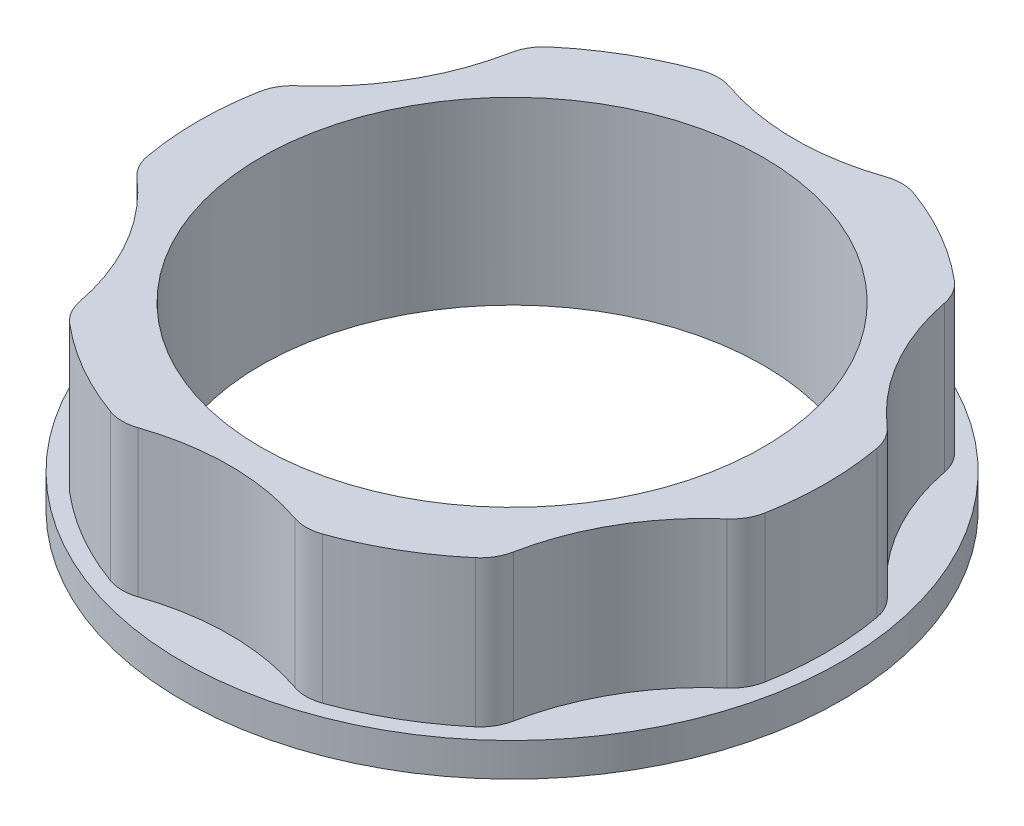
ISO-10303-21;
HEADER;
FILE_DESCRIPTION(('STEP AP214'),'2;1');
FILE_NAME('part.step','',(''),(''),'','','');
FILE_SCHEMA(('AUTOMOTIVE_DESIGN { 1 0 10303 214 1 1 1 1 }'));
ENDSEC;
DATA;
#1=APPLICATION_CONTEXT('core data for automotive mechanical design processes');
#2=APPLICATION_PROTOCOL_DEFINITION('international standard','automotive_design',2000,#1);
#3=PRODUCT_CONTEXT('',#1,'mechanical');
#4=PRODUCT('Part','Part','',(#3));
#5=PRODUCT_RELATED_PRODUCT_CATEGORY('part','',(#4));
#6=PRODUCT_DEFINITION_FORMATION('','',#4);
#7=PRODUCT_DEFINITION_CONTEXT('part definition',#1,'design');
#8=PRODUCT_DEFINITION('design','',#6,#7);
#9=PRODUCT_DEFINITION_SHAPE('','',#8);
#10=(LENGTH_UNIT() NAMED_UNIT(*) SI_UNIT(.MILLI.,.METRE.));
#11=(NAMED_UNIT(*) PLANE_ANGLE_UNIT() SI_UNIT($,.RADIAN.));
#12=(NAMED_UNIT(*) SI_UNIT($,.STERADIAN.) SOLID_ANGLE_UNIT());
#13=UNCERTAINTY_MEASURE_WITH_UNIT(LENGTH_MEASURE(1.E-05),#10,'distance_accuracy_value','');
#14=(GEOMETRIC_REPRESENTATION_CONTEXT(3) GLOBAL_UNCERTAINTY_ASSIGNED_CONTEXT((#13)) GLOBAL_UNIT_ASSIGNED_CONTEXT((#10,
#11,#12)) REPRESENTATION_CONTEXT('',''));
#15=CARTESIAN_POINT('',(0.,0.,0.));
#16=DIRECTION('',(0.,0.,1.));
#17=DIRECTION('',(1.,0.,0.));
#18=AXIS2_PLACEMENT_3D('',#15,#16,#17);
#19=CARTESIAN_POINT('',(-2.19685997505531,7.,-6.1175));
#20=DIRECTION('',(0.,1.,0.));
#21=DIRECTION('',(0.,0.,1.));
#22=AXIS2_PLACEMENT_3D('',#19,#20,#21);
#23=PLANE('',#22);
#24=CARTESIAN_POINT('',(-4.39371995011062,7.,-12.235));
#25=DIRECTION('',(0.,1.,0.));
#26=DIRECTION('',(0.,0.,1.));
#27=AXIS2_PLACEMENT_3D('',#24,#25,#26);
#28=CIRCLE('',#27,2.);
#29=CARTESIAN_POINT('',(-3.74279847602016,7.,-14.1261111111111));
#30=VERTEX_POINT('',#29);
#31=CARTESIAN_POINT('',(-5.06967686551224,7.,-14.1173076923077));
#32=VERTEX_POINT('',#31);
#33=EDGE_CURVE('E200',#30,#32,#28,.T.);
#34=ORIENTED_EDGE('',*,*,#33,.T.);
#35=CARTESIAN_POINT('',(0.,7.,0.));
#36=DIRECTION('',(0.,1.,0.));
#37=DIRECTION('',(0.,0.,1.));
#38=AXIS2_PLACEMENT_3D('',#35,#36,#37);
#39=CIRCLE('',#38,15.);
#40=CARTESIAN_POINT('',(-9.69110866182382,7.,-11.4491228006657));
#41=VERTEX_POINT('',#40);
#42=EDGE_CURVE('E286',#32,#41,#39,.T.);
#43=ORIENTED_EDGE('',*,*,#42,.T.);
#44=CARTESIAN_POINT('',(-8.39896084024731,7.,-9.92257309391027));
#45=DIRECTION('',(0.,1.,0.));
#46=DIRECTION('',(0.,0.,-1.));
#47=AXIS2_PLACEMENT_3D('',#44,#45,#46);
#48=CIRCLE('',#47,2.);
#49=CARTESIAN_POINT('',(-10.3621718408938,7.,-10.3044141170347));
#50=VERTEX_POINT('',#49);
#51=EDGE_CURVE('E282',#41,#50,#48,.T.);
#52=ORIENTED_EDGE('',*,*,#51,.T.);
#53=CARTESIAN_POINT('',(-21.650635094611,7.,-12.5));
#54=DIRECTION('',(0.,-1.,0.));
#55=DIRECTION('',(0.,0.,1.));
#56=AXIS2_PLACEMENT_3D('',#53,#54,#55);
#57=CIRCLE('',#56,11.5);
#58=CARTESIAN_POINT('',(-14.1049703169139,7.,-3.82169699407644));
#59=VERTEX_POINT('',#58);
#60=EDGE_CURVE('E441',#50,#59,#57,.T.);
#61=ORIENTED_EDGE('',*,*,#60,.T.);
#62=CARTESIAN_POINT('',(-12.7926807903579,7.,-2.31242690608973));
#63=DIRECTION('',(0.,1.,0.));
#64=DIRECTION('',(0.,0.,1.));
#65=AXIS2_PLACEMENT_3D('',#62,#63,#64);
#66=CIRCLE('',#65,2.);
#67=CARTESIAN_POINT('',(-14.760785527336,7.,-2.66818489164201));
#68=VERTEX_POINT('',#67);
#69=EDGE_CURVE('E437',#59,#68,#66,.T.);
#70=ORIENTED_EDGE('',*,*,#69,.T.);
#71=CARTESIAN_POINT('',(0.,7.,0.));
#72=DIRECTION('',(0.,1.,0.));
#73=DIRECTION('',(0.,0.,1.));
#74=AXIS2_PLACEMENT_3D('',#71,#72,#73);
#75=CIRCLE('',#74,15.);
#76=CARTESIAN_POINT('',(-14.7607855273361,7.,2.66818489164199));
#77=VERTEX_POINT('',#76);
#78=EDGE_CURVE('E431',#68,#77,#75,.T.);
#79=ORIENTED_EDGE('',*,*,#78,.T.);
#80=CARTESIAN_POINT('',(-12.7926807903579,7.,2.31242690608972));
#81=DIRECTION('',(0.,1.,0.));
#82=DIRECTION('',(0.,0.,-1.));
#83=AXIS2_PLACEMENT_3D('',#80,#81,#82);
#84=CIRCLE('',#83,2.);
#85=CARTESIAN_POINT('',(-14.1049703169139,7.,3.82169699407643));
#86=VERTEX_POINT('',#85);
#87=EDGE_CURVE('E427',#77,#86,#84,.T.);
#88=ORIENTED_EDGE('',*,*,#87,.T.);
#89=CARTESIAN_POINT('',(-21.650635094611,7.,12.5));
#90=DIRECTION('',(0.,-1.,0.));
#91=DIRECTION('',(0.,0.,1.));
#92=AXIS2_PLACEMENT_3D('',#89,#90,#91);
#93=CIRCLE('',#92,11.5);
#94=CARTESIAN_POINT('',(-10.3621718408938,7.,10.3044141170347));
#95=VERTEX_POINT('',#94);
#96=EDGE_CURVE('E421',#86,#95,#93,.T.);
#97=ORIENTED_EDGE('',*,*,#96,.T.);
#98=CARTESIAN_POINT('',(-8.39896084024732,7.,9.92257309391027));
#99=DIRECTION('',(0.,1.,0.));
#100=DIRECTION('',(0.,0.,1.));
#101=AXIS2_PLACEMENT_3D('',#98,#99,#100);
#102=CIRCLE('',#101,2.);
#103=CARTESIAN_POINT('',(-9.69110866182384,7.,11.4491228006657));
#104=VERTEX_POINT('',#103);
#105=EDGE_CURVE('E417',#95,#104,#102,.T.);
#106=ORIENTED_EDGE('',*,*,#105,.T.);
#107=CARTESIAN_POINT('',(0.,7.,0.));
#108=DIRECTION('',(0.,1.,0.));
#109=DIRECTION('',(0.,0.,1.));
#110=AXIS2_PLACEMENT_3D('',#107,#108,#109);
#111=CIRCLE('',#110,15.);
#112=CARTESIAN_POINT('',(-5.06967686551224,7.,14.1173076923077));
#113=VERTEX_POINT('',#112);
#114=EDGE_CURVE('E411',#104,#113,#111,.T.);
#115=ORIENTED_EDGE('',*,*,#114,.T.);
#116=CARTESIAN_POINT('',(-4.39371995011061,7.,12.235));
#117=DIRECTION('',(0.,1.,0.));
#118=DIRECTION('',(0.,0.,-1.));
#119=AXIS2_PLACEMENT_3D('',#116,#117,#118);
#120=CIRCLE('',#119,2.);
#121=CARTESIAN_POINT('',(-3.74279847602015,7.,14.1261111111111));
#122=VERTEX_POINT('',#121);
#123=EDGE_CURVE('E407',#113,#122,#120,.T.);
#124=ORIENTED_EDGE('',*,*,#123,.T.);
#125=CARTESIAN_POINT('',(0.,7.,25.));
#126=DIRECTION('',(0.,-1.,0.));
#127=DIRECTION('',(0.,0.,1.));
#128=AXIS2_PLACEMENT_3D('',#125,#126,#127);
#129=CIRCLE('',#128,11.5);
#130=CARTESIAN_POINT('',(3.74279847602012,7.,14.1261111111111));
#131=VERTEX_POINT('',#130);
#132=EDGE_CURVE('E401',#122,#131,#129,.T.);
#133=ORIENTED_EDGE('',*,*,#132,.T.);
#134=CARTESIAN_POINT('',(4.39371995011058,7.,12.235));
#135=DIRECTION('',(0.,1.,0.));
#136=DIRECTION('',(0.,0.,1.));
#137=AXIS2_PLACEMENT_3D('',#134,#135,#136);
#138=CIRCLE('',#137,2.);
#139=CARTESIAN_POINT('',(5.06967686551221,7.,14.1173076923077));
#140=VERTEX_POINT('',#139);
#141=EDGE_CURVE('E397',#131,#140,#138,.T.);
#142=ORIENTED_EDGE('',*,*,#141,.T.);
#143=CARTESIAN_POINT('',(0.,7.,0.));
#144=DIRECTION('',(0.,1.,0.));
#145=DIRECTION('',(0.,0.,1.));
#146=AXIS2_PLACEMENT_3D('',#143,#144,#145);
#147=CIRCLE('',#146,15.);
#148=CARTESIAN_POINT('',(9.69110866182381,7.,11.4491228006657));
#149=VERTEX_POINT('',#148);
#150=EDGE_CURVE('E391',#140,#149,#147,.T.);
#151=ORIENTED_EDGE('',*,*,#150,.T.);
#152=CARTESIAN_POINT('',(8.39896084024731,7.,9.92257309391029));
#153=DIRECTION('',(0.,1.,0.));
#154=DIRECTION('',(0.,0.,-1.));
#155=AXIS2_PLACEMENT_3D('',#152,#153,#154);
#156=CIRCLE('',#155,2.);
#157=CARTESIAN_POINT('',(10.3621718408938,7.,10.3044141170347));
#158=VERTEX_POINT('',#157);
#159=EDGE_CURVE('E387',#149,#158,#156,.T.);
#160=ORIENTED_EDGE('',*,*,#159,.T.);
#161=CARTESIAN_POINT('',(21.650635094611,7.,12.5));
#162=DIRECTION('',(0.,-1.,0.));
#163=DIRECTION('',(0.,0.,1.));
#164=AXIS2_PLACEMENT_3D('',#161,#162,#163);
#165=CIRCLE('',#164,11.5);
#166=CARTESIAN_POINT('',(14.1049703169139,7.,3.82169699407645));
#167=VERTEX_POINT('',#166);
#168=EDGE_CURVE('E381',#158,#167,#165,.T.);
#169=ORIENTED_EDGE('',*,*,#168,.T.);
#170=CARTESIAN_POINT('',(12.7926807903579,7.,2.31242690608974));
#171=DIRECTION('',(0.,1.,0.));
#172=DIRECTION('',(0.,0.,1.));
#173=AXIS2_PLACEMENT_3D('',#170,#171,#172);
#174=CIRCLE('',#173,2.);
#175=CARTESIAN_POINT('',(14.760785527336,7.,2.668184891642));
#176=VERTEX_POINT('',#175);
#177=EDGE_CURVE('E377',#167,#176,#174,.T.);
#178=ORIENTED_EDGE('',*,*,#177,.T.);
#179=CARTESIAN_POINT('',(0.,7.,0.));
#180=DIRECTION('',(0.,1.,0.));
#181=DIRECTION('',(0.,0.,1.));
#182=AXIS2_PLACEMENT_3D('',#179,#180,#181);
#183=CIRCLE('',#182,15.);
#184=CARTESIAN_POINT('',(14.7607855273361,7.,-2.66818489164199));
#185=VERTEX_POINT('',#184);
#186=EDGE_CURVE('E371',#176,#185,#183,.T.);
#187=ORIENTED_EDGE('',*,*,#186,.T.);
#188=CARTESIAN_POINT('',(12.7926807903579,7.,-2.31242690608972));
#189=DIRECTION('',(0.,1.,0.));
#190=DIRECTION('',(0.,0.,-1.));
#191=AXIS2_PLACEMENT_3D('',#188,#189,#190);
#192=CIRCLE('',#191,2.);
#193=CARTESIAN_POINT('',(14.1049703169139,7.,-3.82169699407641));
#194=VERTEX_POINT('',#193);
#195=EDGE_CURVE('E367',#185,#194,#192,.T.);
#196=ORIENTED_EDGE('',*,*,#195,.T.);
#197=CARTESIAN_POINT('',(21.650635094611,7.,-12.5));
#198=DIRECTION('',(0.,-1.,0.));
#199=DIRECTION('',(0.,0.,1.));
#200=AXIS2_PLACEMENT_3D('',#197,#198,#199);
#201=CIRCLE('',#200,11.5);
#202=CARTESIAN_POINT('',(10.3621718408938,7.,-10.3044141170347));
#203=VERTEX_POINT('',#202);
#204=EDGE_CURVE('E361',#194,#203,#201,.T.);
#205=ORIENTED_EDGE('',*,*,#204,.T.);
#206=CARTESIAN_POINT('',(8.39896084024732,7.,-9.92257309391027));
#207=DIRECTION('',(0.,1.,0.));
#208=DIRECTION('',(0.,0.,1.));
#209=AXIS2_PLACEMENT_3D('',#206,#207,#208);
#210=CIRCLE('',#209,2.);
#211=CARTESIAN_POINT('',(9.69110866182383,7.,-11.4491228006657));
#212=VERTEX_POINT('',#211);
#213=EDGE_CURVE('E357',#203,#212,#210,.T.);
#214=ORIENTED_EDGE('',*,*,#213,.T.);
#215=CARTESIAN_POINT('',(0.,7.,0.));
#216=DIRECTION('',(0.,1.,0.));
#217=DIRECTION('',(0.,0.,1.));
#218=AXIS2_PLACEMENT_3D('',#215,#216,#217);
#219=CIRCLE('',#218,15.);
#220=CARTESIAN_POINT('',(5.06967686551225,7.,-14.1173076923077));
#221=VERTEX_POINT('',#220);
#222=EDGE_CURVE('E463',#212,#221,#219,.T.);
#223=ORIENTED_EDGE('',*,*,#222,.T.);
#224=CARTESIAN_POINT('',(4.39371995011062,7.,-12.235));
#225=DIRECTION('',(0.,1.,0.));
#226=DIRECTION('',(0.,0.,-1.));
#227=AXIS2_PLACEMENT_3D('',#224,#225,#226);
#228=CIRCLE('',#227,2.);
#229=CARTESIAN_POINT('',(3.74279847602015,7.,-14.1261111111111));
#230=VERTEX_POINT('',#229);
#231=EDGE_CURVE('E465',#221,#230,#228,.T.);
#232=ORIENTED_EDGE('',*,*,#231,.T.);
#233=CARTESIAN_POINT('',(0.,7.,-25.));
#234=DIRECTION('',(0.,-1.,0.));
#235=DIRECTION('',(0.,0.,1.));
#236=AXIS2_PLACEMENT_3D('',#233,#234,#235);
#237=CIRCLE('',#236,11.5);
#238=EDGE_CURVE('E49',#230,#30,#237,.T.);
#239=ORIENTED_EDGE('',*,*,#238,.T.);
#240=EDGE_LOOP('',(#34,#43,#52,#61,#70,#79,#88,#97,#106,#115,#124,#133,#142,#151,#160,#169,#178,
#187,#196,#205,#214,#223,#232,#239));
#241=FACE_BOUND('',#240,.T.);
#242=CARTESIAN_POINT('',(0.,7.,0.));
#243=DIRECTION('',(0.,1.,0.));
#244=DIRECTION('',(0.,0.,1.));
#245=AXIS2_PLACEMENT_3D('',#242,#243,#244);
#246=CIRCLE('',#245,12.);
#247=CARTESIAN_POINT('',(0.,7.,12.));
#248=VERTEX_POINT('',#247);
#249=EDGE_CURVE('E292',#248,#248,#246,.T.);
#250=ORIENTED_EDGE('',*,*,#249,.F.);
#251=EDGE_LOOP('',(#250));
#252=FACE_BOUND('',#251,.T.);
#253=ADVANCED_FACE('F33',(#241,#252),#23,.T.);
#254=CARTESIAN_POINT('',(-4.39371995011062,7.,-12.235));
#255=DIRECTION('',(0.,-1.,0.));
#256=DIRECTION('',(0.,0.,-1.));
#257=AXIS2_PLACEMENT_3D('',#254,#255,#256);
#258=CYLINDRICAL_SURFACE('',#257,2.);
#259=CARTESIAN_POINT('',(-4.39371995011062,0.,-12.235));
#260=DIRECTION('',(0.,1.,0.));
#261=DIRECTION('',(0.,0.,1.));
#262=AXIS2_PLACEMENT_3D('',#259,#260,#261);
#263=CIRCLE('',#262,2.);
#264=CARTESIAN_POINT('',(-3.74279847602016,0.,-14.1261111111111));
#265=VERTEX_POINT('',#264);
#266=CARTESIAN_POINT('',(-5.06967686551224,0.,-14.1173076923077));
#267=VERTEX_POINT('',#266);
#268=EDGE_CURVE('E196',#265,#267,#263,.T.);
#269=ORIENTED_EDGE('',*,*,#268,.T.);
#270=DIRECTION('',(0.,-1.,0.));
#271=VECTOR('',#270,1.);
#272=CARTESIAN_POINT('',(-5.06967686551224,7.,-14.1173076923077));
#273=LINE('',#272,#271);
#274=EDGE_CURVE('E11',#32,#267,#273,.T.);
#275=ORIENTED_EDGE('',*,*,#274,.F.);
#276=ORIENTED_EDGE('',*,*,#33,.F.);
#277=DIRECTION('',(0.,-1.,0.));
#278=VECTOR('',#277,1.);
#279=CARTESIAN_POINT('',(-3.74279847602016,7.,-14.1261111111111));
#280=LINE('',#279,#278);
#281=EDGE_CURVE('E213',#30,#265,#280,.T.);
#282=ORIENTED_EDGE('',*,*,#281,.T.);
#283=EDGE_LOOP('',(#269,#275,#276,#282));
#284=FACE_BOUND('',#283,.T.);
#285=ADVANCED_FACE('F35',(#284),#258,.T.);
#286=CARTESIAN_POINT('',(0.,7.,0.));
#287=DIRECTION('',(0.,-1.,0.));
#288=DIRECTION('',(0.,0.,-1.));
#289=AXIS2_PLACEMENT_3D('',#286,#287,#288);
#290=CYLINDRICAL_SURFACE('',#289,15.);
#291=CARTESIAN_POINT('',(0.,0.,0.));
#292=DIRECTION('',(0.,1.,0.));
#293=DIRECTION('',(0.,0.,1.));
#294=AXIS2_PLACEMENT_3D('',#291,#292,#293);
#295=CIRCLE('',#294,15.);
#296=CARTESIAN_POINT('',(-9.69110866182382,0.,-11.4491228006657));
#297=VERTEX_POINT('',#296);
#298=EDGE_CURVE('E287',#267,#297,#295,.T.);
#299=ORIENTED_EDGE('',*,*,#298,.T.);
#300=DIRECTION('',(0.,-1.,0.));
#301=VECTOR('',#300,1.);
#302=CARTESIAN_POINT('',(-9.69110866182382,7.,-11.4491228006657));
#303=LINE('',#302,#301);
#304=EDGE_CURVE('E42',#41,#297,#303,.T.);
#305=ORIENTED_EDGE('',*,*,#304,.F.);
#306=ORIENTED_EDGE('',*,*,#42,.F.);
#307=ORIENTED_EDGE('',*,*,#274,.T.);
#308=EDGE_LOOP('',(#299,#305,#306,#307));
#309=FACE_BOUND('',#308,.T.);
#310=ADVANCED_FACE('F285',(#309),#290,.T.);
#311=CARTESIAN_POINT('',(-8.39896084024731,7.,-9.92257309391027));
#312=DIRECTION('',(0.,-1.,0.));
#313=DIRECTION('',(0.,0.,-1.));
#314=AXIS2_PLACEMENT_3D('',#311,#312,#313);
#315=CYLINDRICAL_SURFACE('',#314,2.);
#316=CARTESIAN_POINT('',(-8.39896084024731,0.,-9.92257309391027));
#317=DIRECTION('',(0.,1.,0.));
#318=DIRECTION('',(0.,0.,-1.));
#319=AXIS2_PLACEMENT_3D('',#316,#317,#318);
#320=CIRCLE('',#319,2.);
#321=CARTESIAN_POINT('',(-10.3621718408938,0.,-10.3044141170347));
#322=VERTEX_POINT('',#321);
#323=EDGE_CURVE('E281',#297,#322,#320,.T.);
#324=ORIENTED_EDGE('',*,*,#323,.T.);
#325=DIRECTION('',(0.,-1.,0.));
#326=VECTOR('',#325,1.);
#327=CARTESIAN_POINT('',(-10.3621718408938,7.,-10.3044141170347));
#328=LINE('',#327,#326);
#329=EDGE_CURVE('E272',#50,#322,#328,.T.);
#330=ORIENTED_EDGE('',*,*,#329,.F.);
#331=ORIENTED_EDGE('',*,*,#51,.F.);
#332=ORIENTED_EDGE('',*,*,#304,.T.);
#333=EDGE_LOOP('',(#324,#330,#331,#332));
#334=FACE_BOUND('',#333,.T.);
#335=ADVANCED_FACE('F279',(#334),#315,.T.);
#336=CARTESIAN_POINT('',(-21.650635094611,7.,-12.5));
#337=DIRECTION('',(0.,-1.,0.));
#338=DIRECTION('',(0.,0.,-1.));
#339=AXIS2_PLACEMENT_3D('',#336,#337,#338);
#340=CYLINDRICAL_SURFACE('',#339,11.5);
#341=CARTESIAN_POINT('',(-21.650635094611,0.,-12.5));
#342=DIRECTION('',(0.,-1.,0.));
#343=DIRECTION('',(0.,0.,1.));
#344=AXIS2_PLACEMENT_3D('',#341,#342,#343);
#345=CIRCLE('',#344,11.5);
#346=CARTESIAN_POINT('',(-14.1049703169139,0.,-3.82169699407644));
#347=VERTEX_POINT('',#346);
#348=EDGE_CURVE('E290',#322,#347,#345,.T.);
#349=ORIENTED_EDGE('',*,*,#348,.T.);
#350=DIRECTION('',(0.,-1.,0.));
#351=VECTOR('',#350,1.);
#352=CARTESIAN_POINT('',(-14.1049703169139,7.,-3.82169699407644));
#353=LINE('',#352,#351);
#354=EDGE_CURVE('E269',#59,#347,#353,.T.);
#355=ORIENTED_EDGE('',*,*,#354,.F.);
#356=ORIENTED_EDGE('',*,*,#60,.F.);
#357=ORIENTED_EDGE('',*,*,#329,.T.);
#358=EDGE_LOOP('',(#349,#355,#356,#357));
#359=FACE_BOUND('',#358,.T.);
#360=ADVANCED_FACE('F440',(#359),#340,.F.);
#361=CARTESIAN_POINT('',(-12.7926807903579,7.,-2.31242690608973));
#362=DIRECTION('',(0.,-1.,0.));
#363=DIRECTION('',(0.,0.,-1.));
#364=AXIS2_PLACEMENT_3D('',#361,#362,#363);
#365=CYLINDRICAL_SURFACE('',#364,2.);
#366=CARTESIAN_POINT('',(-12.7926807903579,0.,-2.31242690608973));
#367=DIRECTION('',(0.,1.,0.));
#368=DIRECTION('',(0.,0.,1.));
#369=AXIS2_PLACEMENT_3D('',#366,#367,#368);
#370=CIRCLE('',#369,2.);
#371=CARTESIAN_POINT('',(-14.760785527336,0.,-2.66818489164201));
#372=VERTEX_POINT('',#371);
#373=EDGE_CURVE('E298',#347,#372,#370,.T.);
#374=ORIENTED_EDGE('',*,*,#373,.T.);
#375=DIRECTION('',(0.,-1.,0.));
#376=VECTOR('',#375,1.);
#377=CARTESIAN_POINT('',(-14.760785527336,7.,-2.66818489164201));
#378=LINE('',#377,#376);
#379=EDGE_CURVE('E266',#68,#372,#378,.T.);
#380=ORIENTED_EDGE('',*,*,#379,.F.);
#381=ORIENTED_EDGE('',*,*,#69,.F.);
#382=ORIENTED_EDGE('',*,*,#354,.T.);
#383=EDGE_LOOP('',(#374,#380,#381,#382));
#384=FACE_BOUND('',#383,.T.);
#385=ADVANCED_FACE('F434',(#384),#365,.T.);
#386=CARTESIAN_POINT('',(0.,7.,0.));
#387=DIRECTION('',(0.,-1.,0.));
#388=DIRECTION('',(0.,0.,-1.));
#389=AXIS2_PLACEMENT_3D('',#386,#387,#388);
#390=CYLINDRICAL_SURFACE('',#389,15.);
#391=CARTESIAN_POINT('',(0.,0.,0.));
#392=DIRECTION('',(0.,1.,0.));
#393=DIRECTION('',(0.,0.,1.));
#394=AXIS2_PLACEMENT_3D('',#391,#392,#393);
#395=CIRCLE('',#394,15.);
#396=CARTESIAN_POINT('',(-14.7607855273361,0.,2.66818489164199));
#397=VERTEX_POINT('',#396);
#398=EDGE_CURVE('E301',#372,#397,#395,.T.);
#399=ORIENTED_EDGE('',*,*,#398,.T.);
#400=DIRECTION('',(0.,-1.,0.));
#401=VECTOR('',#400,1.);
#402=CARTESIAN_POINT('',(-14.7607855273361,7.,2.66818489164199));
#403=LINE('',#402,#401);
#404=EDGE_CURVE('E263',#77,#397,#403,.T.);
#405=ORIENTED_EDGE('',*,*,#404,.F.);
#406=ORIENTED_EDGE('',*,*,#78,.F.);
#407=ORIENTED_EDGE('',*,*,#379,.T.);
#408=EDGE_LOOP('',(#399,#405,#406,#407));
#409=FACE_BOUND('',#408,.T.);
#410=ADVANCED_FACE('F430',(#409),#390,.T.);
#411=CARTESIAN_POINT('',(-12.7926807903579,7.,2.31242690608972));
#412=DIRECTION('',(0.,-1.,0.));
#413=DIRECTION('',(0.,0.,-1.));
#414=AXIS2_PLACEMENT_3D('',#411,#412,#413);
#415=CYLINDRICAL_SURFACE('',#414,2.);
#416=CARTESIAN_POINT('',(-12.7926807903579,0.,2.31242690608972));
#417=DIRECTION('',(0.,1.,0.));
#418=DIRECTION('',(0.,0.,-1.));
#419=AXIS2_PLACEMENT_3D('',#416,#417,#418);
#420=CIRCLE('',#419,2.);
#421=CARTESIAN_POINT('',(-14.1049703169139,0.,3.82169699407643));
#422=VERTEX_POINT('',#421);
#423=EDGE_CURVE('E304',#397,#422,#420,.T.);
#424=ORIENTED_EDGE('',*,*,#423,.T.);
#425=DIRECTION('',(0.,-1.,0.));
#426=VECTOR('',#425,1.);
#427=CARTESIAN_POINT('',(-14.1049703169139,7.,3.82169699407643));
#428=LINE('',#427,#426);
#429=EDGE_CURVE('E260',#86,#422,#428,.T.);
#430=ORIENTED_EDGE('',*,*,#429,.F.);
#431=ORIENTED_EDGE('',*,*,#87,.F.);
#432=ORIENTED_EDGE('',*,*,#404,.T.);
#433=EDGE_LOOP('',(#424,#430,#431,#432));
#434=FACE_BOUND('',#433,.T.);
#435=ADVANCED_FACE('F424',(#434),#415,.T.);
#436=CARTESIAN_POINT('',(-21.650635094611,7.,12.5));
#437=DIRECTION('',(0.,-1.,0.));
#438=DIRECTION('',(0.,0.,-1.));
#439=AXIS2_PLACEMENT_3D('',#436,#437,#438);
#440=CYLINDRICAL_SURFACE('',#439,11.5);
#441=CARTESIAN_POINT('',(-21.650635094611,0.,12.5));
#442=DIRECTION('',(0.,-1.,0.));
#443=DIRECTION('',(0.,0.,1.));
#444=AXIS2_PLACEMENT_3D('',#441,#442,#443);
#445=CIRCLE('',#444,11.5);
#446=CARTESIAN_POINT('',(-10.3621718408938,0.,10.3044141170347));
#447=VERTEX_POINT('',#446);
#448=EDGE_CURVE('E307',#422,#447,#445,.T.);
#449=ORIENTED_EDGE('',*,*,#448,.T.);
#450=DIRECTION('',(0.,-1.,0.));
#451=VECTOR('',#450,1.);
#452=CARTESIAN_POINT('',(-10.3621718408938,7.,10.3044141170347));
#453=LINE('',#452,#451);
#454=EDGE_CURVE('E257',#95,#447,#453,.T.);
#455=ORIENTED_EDGE('',*,*,#454,.F.);
#456=ORIENTED_EDGE('',*,*,#96,.F.);
#457=ORIENTED_EDGE('',*,*,#429,.T.);
#458=EDGE_LOOP('',(#449,#455,#456,#457));
#459=FACE_BOUND('',#458,.T.);
#460=ADVANCED_FACE('F420',(#459),#440,.F.);
#461=CARTESIAN_POINT('',(-8.39896084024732,7.,9.92257309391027));
#462=DIRECTION('',(0.,-1.,0.));
#463=DIRECTION('',(0.,0.,-1.));
#464=AXIS2_PLACEMENT_3D('',#461,#462,#463);
#465=CYLINDRICAL_SURFACE('',#464,2.);
#466=CARTESIAN_POINT('',(-8.39896084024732,0.,9.92257309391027));
#467=DIRECTION('',(0.,1.,0.));
#468=DIRECTION('',(0.,0.,1.));
#469=AXIS2_PLACEMENT_3D('',#466,#467,#468);
#470=CIRCLE('',#469,2.);
#471=CARTESIAN_POINT('',(-9.69110866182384,0.,11.4491228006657));
#472=VERTEX_POINT('',#471);
#473=EDGE_CURVE('E310',#447,#472,#470,.T.);
#474=ORIENTED_EDGE('',*,*,#473,.T.);
#475=DIRECTION('',(0.,-1.,0.));
#476=VECTOR('',#475,1.);
#477=CARTESIAN_POINT('',(-9.69110866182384,7.,11.4491228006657));
#478=LINE('',#477,#476);
#479=EDGE_CURVE('E254',#104,#472,#478,.T.);
#480=ORIENTED_EDGE('',*,*,#479,.F.);
#481=ORIENTED_EDGE('',*,*,#105,.F.);
#482=ORIENTED_EDGE('',*,*,#454,.T.);
#483=EDGE_LOOP('',(#474,#480,#481,#482));
#484=FACE_BOUND('',#483,.T.);
#485=ADVANCED_FACE('F414',(#484),#465,.T.);
#486=CARTESIAN_POINT('',(0.,7.,0.));
#487=DIRECTION('',(0.,-1.,0.));
#488=DIRECTION('',(0.,0.,-1.));
#489=AXIS2_PLACEMENT_3D('',#486,#487,#488);
#490=CYLINDRICAL_SURFACE('',#489,15.);
#491=CARTESIAN_POINT('',(0.,0.,0.));
#492=DIRECTION('',(0.,1.,0.));
#493=DIRECTION('',(0.,0.,1.));
#494=AXIS2_PLACEMENT_3D('',#491,#492,#493);
#495=CIRCLE('',#494,15.);
#496=CARTESIAN_POINT('',(-5.06967686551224,0.,14.1173076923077));
#497=VERTEX_POINT('',#496);
#498=EDGE_CURVE('E313',#472,#497,#495,.T.);
#499=ORIENTED_EDGE('',*,*,#498,.T.);
#500=DIRECTION('',(0.,-1.,0.));
#501=VECTOR('',#500,1.);
#502=CARTESIAN_POINT('',(-5.06967686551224,7.,14.1173076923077));
#503=LINE('',#502,#501);
#504=EDGE_CURVE('E251',#113,#497,#503,.T.);
#505=ORIENTED_EDGE('',*,*,#504,.F.);
#506=ORIENTED_EDGE('',*,*,#114,.F.);
#507=ORIENTED_EDGE('',*,*,#479,.T.);
#508=EDGE_LOOP('',(#499,#505,#506,#507));
#509=FACE_BOUND('',#508,.T.);
#510=ADVANCED_FACE('F410',(#509),#490,.T.);
#511=CARTESIAN_POINT('',(-4.39371995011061,7.,12.235));
#512=DIRECTION('',(0.,-1.,0.));
#513=DIRECTION('',(0.,0.,-1.));
#514=AXIS2_PLACEMENT_3D('',#511,#512,#513);
#515=CYLINDRICAL_SURFACE('',#514,2.);
#516=CARTESIAN_POINT('',(-4.39371995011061,0.,12.235));
#517=DIRECTION('',(0.,1.,0.));
#518=DIRECTION('',(0.,0.,-1.));
#519=AXIS2_PLACEMENT_3D('',#516,#517,#518);
#520=CIRCLE('',#519,2.);
#521=CARTESIAN_POINT('',(-3.74279847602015,0.,14.1261111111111));
#522=VERTEX_POINT('',#521);
#523=EDGE_CURVE('E316',#497,#522,#520,.T.);
#524=ORIENTED_EDGE('',*,*,#523,.T.);
#525=DIRECTION('',(0.,-1.,0.));
#526=VECTOR('',#525,1.);
#527=CARTESIAN_POINT('',(-3.74279847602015,7.,14.1261111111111));
#528=LINE('',#527,#526);
#529=EDGE_CURVE('E248',#122,#522,#528,.T.);
#530=ORIENTED_EDGE('',*,*,#529,.F.);
#531=ORIENTED_EDGE('',*,*,#123,.F.);
#532=ORIENTED_EDGE('',*,*,#504,.T.);
#533=EDGE_LOOP('',(#524,#530,#531,#532));
#534=FACE_BOUND('',#533,.T.);
#535=ADVANCED_FACE('F404',(#534),#515,.T.);
#536=CARTESIAN_POINT('',(0.,7.,25.));
#537=DIRECTION('',(0.,-1.,0.));
#538=DIRECTION('',(0.,0.,-1.));
#539=AXIS2_PLACEMENT_3D('',#536,#537,#538);
#540=CYLINDRICAL_SURFACE('',#539,11.5);
#541=CARTESIAN_POINT('',(0.,0.,25.));
#542=DIRECTION('',(0.,-1.,0.));
#543=DIRECTION('',(0.,0.,1.));
#544=AXIS2_PLACEMENT_3D('',#541,#542,#543);
#545=CIRCLE('',#544,11.5);
#546=CARTESIAN_POINT('',(3.74279847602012,0.,14.1261111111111));
#547=VERTEX_POINT('',#546);
#548=EDGE_CURVE('E319',#522,#547,#545,.T.);
#549=ORIENTED_EDGE('',*,*,#548,.T.);
#550=DIRECTION('',(0.,-1.,0.));
#551=VECTOR('',#550,1.);
#552=CARTESIAN_POINT('',(3.74279847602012,7.,14.1261111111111));
#553=LINE('',#552,#551);
#554=EDGE_CURVE('E245',#131,#547,#553,.T.);
#555=ORIENTED_EDGE('',*,*,#554,.F.);
#556=ORIENTED_EDGE('',*,*,#132,.F.);
#557=ORIENTED_EDGE('',*,*,#529,.T.);
#558=EDGE_LOOP('',(#549,#555,#556,#557));
#559=FACE_BOUND('',#558,.T.);
#560=ADVANCED_FACE('F400',(#559),#540,.F.);
#561=CARTESIAN_POINT('',(4.39371995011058,7.,12.235));
#562=DIRECTION('',(0.,-1.,0.));
#563=DIRECTION('',(0.,0.,-1.));
#564=AXIS2_PLACEMENT_3D('',#561,#562,#563);
#565=CYLINDRICAL_SURFACE('',#564,2.);
#566=CARTESIAN_POINT('',(4.39371995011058,0.,12.235));
#567=DIRECTION('',(0.,1.,0.));
#568=DIRECTION('',(0.,0.,1.));
#569=AXIS2_PLACEMENT_3D('',#566,#567,#568);
#570=CIRCLE('',#569,2.);
#571=CARTESIAN_POINT('',(5.06967686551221,0.,14.1173076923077));
#572=VERTEX_POINT('',#571);
#573=EDGE_CURVE('E322',#547,#572,#570,.T.);
#574=ORIENTED_EDGE('',*,*,#573,.T.);
#575=DIRECTION('',(0.,-1.,0.));
#576=VECTOR('',#575,1.);
#577=CARTESIAN_POINT('',(5.06967686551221,7.,14.1173076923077));
#578=LINE('',#577,#576);
#579=EDGE_CURVE('E242',#140,#572,#578,.T.);
#580=ORIENTED_EDGE('',*,*,#579,.F.);
#581=ORIENTED_EDGE('',*,*,#141,.F.);
#582=ORIENTED_EDGE('',*,*,#554,.T.);
#583=EDGE_LOOP('',(#574,#580,#581,#582));
#584=FACE_BOUND('',#583,.T.);
#585=ADVANCED_FACE('F394',(#584),#565,.T.);
#586=CARTESIAN_POINT('',(0.,7.,0.));
#587=DIRECTION('',(0.,-1.,0.));
#588=DIRECTION('',(0.,0.,-1.));
#589=AXIS2_PLACEMENT_3D('',#586,#587,#588);
#590=CYLINDRICAL_SURFACE('',#589,15.);
#591=CARTESIAN_POINT('',(0.,0.,0.));
#592=DIRECTION('',(0.,1.,0.));
#593=DIRECTION('',(0.,0.,1.));
#594=AXIS2_PLACEMENT_3D('',#591,#592,#593);
#595=CIRCLE('',#594,15.);
#596=CARTESIAN_POINT('',(9.69110866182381,0.,11.4491228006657));
#597=VERTEX_POINT('',#596);
#598=EDGE_CURVE('E325',#572,#597,#595,.T.);
#599=ORIENTED_EDGE('',*,*,#598,.T.);
#600=DIRECTION('',(0.,-1.,0.));
#601=VECTOR('',#600,1.);
#602=CARTESIAN_POINT('',(9.69110866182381,7.,11.4491228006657));
#603=LINE('',#602,#601);
#604=EDGE_CURVE('E239',#149,#597,#603,.T.);
#605=ORIENTED_EDGE('',*,*,#604,.F.);
#606=ORIENTED_EDGE('',*,*,#150,.F.);
#607=ORIENTED_EDGE('',*,*,#579,.T.);
#608=EDGE_LOOP('',(#599,#605,#606,#607));
#609=FACE_BOUND('',#608,.T.);
#610=ADVANCED_FACE('F390',(#609),#590,.T.);
#611=CARTESIAN_POINT('',(8.39896084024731,7.,9.92257309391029));
#612=DIRECTION('',(0.,-1.,0.));
#613=DIRECTION('',(0.,0.,-1.));
#614=AXIS2_PLACEMENT_3D('',#611,#612,#613);
#615=CYLINDRICAL_SURFACE('',#614,2.);
#616=CARTESIAN_POINT('',(8.39896084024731,0.,9.92257309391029));
#617=DIRECTION('',(0.,1.,0.));
#618=DIRECTION('',(0.,0.,-1.));
#619=AXIS2_PLACEMENT_3D('',#616,#617,#618);
#620=CIRCLE('',#619,2.);
#621=CARTESIAN_POINT('',(10.3621718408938,0.,10.3044141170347));
#622=VERTEX_POINT('',#621);
#623=EDGE_CURVE('E328',#597,#622,#620,.T.);
#624=ORIENTED_EDGE('',*,*,#623,.T.);
#625=DIRECTION('',(0.,-1.,0.));
#626=VECTOR('',#625,1.);
#627=CARTESIAN_POINT('',(10.3621718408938,7.,10.3044141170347));
#628=LINE('',#627,#626);
#629=EDGE_CURVE('E236',#158,#622,#628,.T.);
#630=ORIENTED_EDGE('',*,*,#629,.F.);
#631=ORIENTED_EDGE('',*,*,#159,.F.);
#632=ORIENTED_EDGE('',*,*,#604,.T.);
#633=EDGE_LOOP('',(#624,#630,#631,#632));
#634=FACE_BOUND('',#633,.T.);
#635=ADVANCED_FACE('F384',(#634),#615,.T.);
#636=CARTESIAN_POINT('',(21.650635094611,7.,12.5));
#637=DIRECTION('',(0.,-1.,0.));
#638=DIRECTION('',(0.,0.,-1.));
#639=AXIS2_PLACEMENT_3D('',#636,#637,#638);
#640=CYLINDRICAL_SURFACE('',#639,11.5);
#641=CARTESIAN_POINT('',(21.650635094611,0.,12.5));
#642=DIRECTION('',(0.,-1.,0.));
#643=DIRECTION('',(0.,0.,1.));
#644=AXIS2_PLACEMENT_3D('',#641,#642,#643);
#645=CIRCLE('',#644,11.5);
#646=CARTESIAN_POINT('',(14.1049703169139,0.,3.82169699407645));
#647=VERTEX_POINT('',#646);
#648=EDGE_CURVE('E331',#622,#647,#645,.T.);
#649=ORIENTED_EDGE('',*,*,#648,.T.);
#650=DIRECTION('',(0.,-1.,0.));
#651=VECTOR('',#650,1.);
#652=CARTESIAN_POINT('',(14.1049703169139,7.,3.82169699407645));
#653=LINE('',#652,#651);
#654=EDGE_CURVE('E233',#167,#647,#653,.T.);
#655=ORIENTED_EDGE('',*,*,#654,.F.);
#656=ORIENTED_EDGE('',*,*,#168,.F.);
#657=ORIENTED_EDGE('',*,*,#629,.T.);
#658=EDGE_LOOP('',(#649,#655,#656,#657));
#659=FACE_BOUND('',#658,.T.);
#660=ADVANCED_FACE('F380',(#659),#640,.F.);
#661=CARTESIAN_POINT('',(12.7926807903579,7.,2.31242690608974));
#662=DIRECTION('',(0.,-1.,0.));
#663=DIRECTION('',(0.,0.,-1.));
#664=AXIS2_PLACEMENT_3D('',#661,#662,#663);
#665=CYLINDRICAL_SURFACE('',#664,2.);
#666=CARTESIAN_POINT('',(12.7926807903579,0.,2.31242690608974));
#667=DIRECTION('',(0.,1.,0.));
#668=DIRECTION('',(0.,0.,1.));
#669=AXIS2_PLACEMENT_3D('',#666,#667,#668);
#670=CIRCLE('',#669,2.);
#671=CARTESIAN_POINT('',(14.7607855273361,0.,2.668184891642));
#672=VERTEX_POINT('',#671);
#673=EDGE_CURVE('E334',#647,#672,#670,.T.);
#674=ORIENTED_EDGE('',*,*,#673,.T.);
#675=DIRECTION('',(0.,-1.,0.));
#676=VECTOR('',#675,1.);
#677=CARTESIAN_POINT('',(14.760785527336,7.,2.668184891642));
#678=LINE('',#677,#676);
#679=EDGE_CURVE('E230',#176,#672,#678,.T.);
#680=ORIENTED_EDGE('',*,*,#679,.F.);
#681=ORIENTED_EDGE('',*,*,#177,.F.);
#682=ORIENTED_EDGE('',*,*,#654,.T.);
#683=EDGE_LOOP('',(#674,#680,#681,#682));
#684=FACE_BOUND('',#683,.T.);
#685=ADVANCED_FACE('F374',(#684),#665,.T.);
#686=CARTESIAN_POINT('',(0.,7.,0.));
#687=DIRECTION('',(0.,-1.,0.));
#688=DIRECTION('',(0.,0.,-1.));
#689=AXIS2_PLACEMENT_3D('',#686,#687,#688);
#690=CYLINDRICAL_SURFACE('',#689,15.);
#691=CARTESIAN_POINT('',(0.,0.,0.));
#692=DIRECTION('',(0.,1.,0.));
#693=DIRECTION('',(0.,0.,1.));
#694=AXIS2_PLACEMENT_3D('',#691,#692,#693);
#695=CIRCLE('',#694,15.);
#696=CARTESIAN_POINT('',(14.7607855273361,0.,-2.66818489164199));
#697=VERTEX_POINT('',#696);
#698=EDGE_CURVE('E337',#672,#697,#695,.T.);
#699=ORIENTED_EDGE('',*,*,#698,.T.);
#700=DIRECTION('',(0.,-1.,0.));
#701=VECTOR('',#700,1.);
#702=CARTESIAN_POINT('',(14.7607855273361,7.,-2.66818489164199));
#703=LINE('',#702,#701);
#704=EDGE_CURVE('E227',#185,#697,#703,.T.);
#705=ORIENTED_EDGE('',*,*,#704,.F.);
#706=ORIENTED_EDGE('',*,*,#186,.F.);
#707=ORIENTED_EDGE('',*,*,#679,.T.);
#708=EDGE_LOOP('',(#699,#705,#706,#707));
#709=FACE_BOUND('',#708,.T.);
#710=ADVANCED_FACE('F370',(#709),#690,.T.);
#711=CARTESIAN_POINT('',(12.7926807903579,7.,-2.31242690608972));
#712=DIRECTION('',(0.,-1.,0.));
#713=DIRECTION('',(0.,0.,-1.));
#714=AXIS2_PLACEMENT_3D('',#711,#712,#713);
#715=CYLINDRICAL_SURFACE('',#714,2.);
#716=CARTESIAN_POINT('',(12.7926807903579,0.,-2.31242690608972));
#717=DIRECTION('',(0.,1.,0.));
#718=DIRECTION('',(0.,0.,-1.));
#719=AXIS2_PLACEMENT_3D('',#716,#717,#718);
#720=CIRCLE('',#719,2.);
#721=CARTESIAN_POINT('',(14.1049703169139,0.,-3.82169699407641));
#722=VERTEX_POINT('',#721);
#723=EDGE_CURVE('E340',#697,#722,#720,.T.);
#724=ORIENTED_EDGE('',*,*,#723,.T.);
#725=DIRECTION('',(0.,-1.,0.));
#726=VECTOR('',#725,1.);
#727=CARTESIAN_POINT('',(14.1049703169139,7.,-3.82169699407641));
#728=LINE('',#727,#726);
#729=EDGE_CURVE('E224',#194,#722,#728,.T.);
#730=ORIENTED_EDGE('',*,*,#729,.F.);
#731=ORIENTED_EDGE('',*,*,#195,.F.);
#732=ORIENTED_EDGE('',*,*,#704,.T.);
#733=EDGE_LOOP('',(#724,#730,#731,#732));
#734=FACE_BOUND('',#733,.T.);
#735=ADVANCED_FACE('F364',(#734),#715,.T.);
#736=CARTESIAN_POINT('',(21.650635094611,7.,-12.5));
#737=DIRECTION('',(0.,-1.,0.));
#738=DIRECTION('',(0.,0.,-1.));
#739=AXIS2_PLACEMENT_3D('',#736,#737,#738);
#740=CYLINDRICAL_SURFACE('',#739,11.5);
#741=CARTESIAN_POINT('',(21.650635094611,0.,-12.5));
#742=DIRECTION('',(0.,-1.,0.));
#743=DIRECTION('',(0.,0.,1.));
#744=AXIS2_PLACEMENT_3D('',#741,#742,#743);
#745=CIRCLE('',#744,11.5);
#746=CARTESIAN_POINT('',(10.3621718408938,0.,-10.3044141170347));
#747=VERTEX_POINT('',#746);
#748=EDGE_CURVE('E343',#722,#747,#745,.T.);
#749=ORIENTED_EDGE('',*,*,#748,.T.);
#750=DIRECTION('',(0.,-1.,0.));
#751=VECTOR('',#750,1.);
#752=CARTESIAN_POINT('',(10.3621718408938,7.,-10.3044141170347));
#753=LINE('',#752,#751);
#754=EDGE_CURVE('E221',#203,#747,#753,.T.);
#755=ORIENTED_EDGE('',*,*,#754,.F.);
#756=ORIENTED_EDGE('',*,*,#204,.F.);
#757=ORIENTED_EDGE('',*,*,#729,.T.);
#758=EDGE_LOOP('',(#749,#755,#756,#757));
#759=FACE_BOUND('',#758,.T.);
#760=ADVANCED_FACE('F360',(#759),#740,.F.);
#761=CARTESIAN_POINT('',(8.39896084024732,7.,-9.92257309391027));
#762=DIRECTION('',(0.,-1.,0.));
#763=DIRECTION('',(0.,0.,-1.));
#764=AXIS2_PLACEMENT_3D('',#761,#762,#763);
#765=CYLINDRICAL_SURFACE('',#764,2.);
#766=CARTESIAN_POINT('',(8.39896084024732,0.,-9.92257309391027));
#767=DIRECTION('',(0.,1.,0.));
#768=DIRECTION('',(0.,0.,1.));
#769=AXIS2_PLACEMENT_3D('',#766,#767,#768);
#770=CIRCLE('',#769,2.);
#771=CARTESIAN_POINT('',(9.69110866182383,0.,-11.4491228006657));
#772=VERTEX_POINT('',#771);
#773=EDGE_CURVE('E346',#747,#772,#770,.T.);
#774=ORIENTED_EDGE('',*,*,#773,.T.);
#775=DIRECTION('',(0.,-1.,0.));
#776=VECTOR('',#775,1.);
#777=CARTESIAN_POINT('',(9.69110866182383,7.,-11.4491228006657));
#778=LINE('',#777,#776);
#779=EDGE_CURVE('E215',#212,#772,#778,.T.);
#780=ORIENTED_EDGE('',*,*,#779,.F.);
#781=ORIENTED_EDGE('',*,*,#213,.F.);
#782=ORIENTED_EDGE('',*,*,#754,.T.);
#783=EDGE_LOOP('',(#774,#780,#781,#782));
#784=FACE_BOUND('',#783,.T.);
#785=ADVANCED_FACE('F354',(#784),#765,.T.);
#786=CARTESIAN_POINT('',(0.,7.,0.));
#787=DIRECTION('',(0.,-1.,0.));
#788=DIRECTION('',(0.,0.,-1.));
#789=AXIS2_PLACEMENT_3D('',#786,#787,#788);
#790=CYLINDRICAL_SURFACE('',#789,15.);
#791=CARTESIAN_POINT('',(0.,0.,0.));
#792=DIRECTION('',(0.,1.,0.));
#793=DIRECTION('',(0.,0.,1.));
#794=AXIS2_PLACEMENT_3D('',#791,#792,#793);
#795=CIRCLE('',#794,15.);
#796=CARTESIAN_POINT('',(5.06967686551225,0.,-14.1173076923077));
#797=VERTEX_POINT('',#796);
#798=EDGE_CURVE('E210',#772,#797,#795,.T.);
#799=ORIENTED_EDGE('',*,*,#798,.T.);
#800=DIRECTION('',(0.,-1.,0.));
#801=VECTOR('',#800,1.);
#802=CARTESIAN_POINT('',(5.06967686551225,7.,-14.1173076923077));
#803=LINE('',#802,#801);
#804=EDGE_CURVE('E209',#221,#797,#803,.T.);
#805=ORIENTED_EDGE('',*,*,#804,.F.);
#806=ORIENTED_EDGE('',*,*,#222,.F.);
#807=ORIENTED_EDGE('',*,*,#779,.T.);
#808=EDGE_LOOP('',(#799,#805,#806,#807));
#809=FACE_BOUND('',#808,.T.);
#810=ADVANCED_FACE('F350',(#809),#790,.T.);
#811=CARTESIAN_POINT('',(4.39371995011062,7.,-12.235));
#812=DIRECTION('',(0.,-1.,0.));
#813=DIRECTION('',(0.,0.,-1.));
#814=AXIS2_PLACEMENT_3D('',#811,#812,#813);
#815=CYLINDRICAL_SURFACE('',#814,2.);
#816=CARTESIAN_POINT('',(4.39371995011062,0.,-12.235));
#817=DIRECTION('',(0.,1.,0.));
#818=DIRECTION('',(0.,0.,-1.));
#819=AXIS2_PLACEMENT_3D('',#816,#817,#818);
#820=CIRCLE('',#819,2.);
#821=CARTESIAN_POINT('',(3.74279847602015,0.,-14.1261111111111));
#822=VERTEX_POINT('',#821);
#823=EDGE_CURVE('E193',#797,#822,#820,.T.);
#824=ORIENTED_EDGE('',*,*,#823,.T.);
#825=DIRECTION('',(0.,-1.,0.));
#826=VECTOR('',#825,1.);
#827=CARTESIAN_POINT('',(3.74279847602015,7.,-14.1261111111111));
#828=LINE('',#827,#826);
#829=EDGE_CURVE('E207',#230,#822,#828,.T.);
#830=ORIENTED_EDGE('',*,*,#829,.F.);
#831=ORIENTED_EDGE('',*,*,#231,.F.);
#832=ORIENTED_EDGE('',*,*,#804,.T.);
#833=EDGE_LOOP('',(#824,#830,#831,#832));
#834=FACE_BOUND('',#833,.T.);
#835=ADVANCED_FACE('F205',(#834),#815,.T.);
#836=CARTESIAN_POINT('',(0.,7.,-25.));
#837=DIRECTION('',(0.,-1.,0.));
#838=DIRECTION('',(0.,0.,-1.));
#839=AXIS2_PLACEMENT_3D('',#836,#837,#838);
#840=CYLINDRICAL_SURFACE('',#839,11.5);
#841=CARTESIAN_POINT('',(0.,0.,-25.));
#842=DIRECTION('',(0.,-1.,0.));
#843=DIRECTION('',(0.,0.,1.));
#844=AXIS2_PLACEMENT_3D('',#841,#842,#843);
#845=CIRCLE('',#844,11.5);
#846=EDGE_CURVE('E190',#822,#265,#845,.T.);
#847=ORIENTED_EDGE('',*,*,#846,.T.);
#848=ORIENTED_EDGE('',*,*,#281,.F.);
#849=ORIENTED_EDGE('',*,*,#238,.F.);
#850=ORIENTED_EDGE('',*,*,#829,.T.);
#851=EDGE_LOOP('',(#847,#848,#849,#850));
#852=FACE_BOUND('',#851,.T.);
#853=ADVANCED_FACE('F212',(#852),#840,.F.);
#854=CARTESIAN_POINT('',(0.,7.,0.));
#855=DIRECTION('',(0.,-1.,0.));
#856=DIRECTION('',(0.,0.,-1.));
#857=AXIS2_PLACEMENT_3D('',#854,#855,#856);
#858=CYLINDRICAL_SURFACE('',#857,12.);
#859=ORIENTED_EDGE('',*,*,#249,.T.);
#860=EDGE_LOOP('',(#859));
#861=FACE_BOUND('',#860,.T.);
#862=CARTESIAN_POINT('',(0.,-1.6,0.));
#863=DIRECTION('',(0.,-1.,0.));
#864=DIRECTION('',(0.,0.,-1.));
#865=AXIS2_PLACEMENT_3D('',#862,#863,#864);
#866=CIRCLE('',#865,12.);
#867=CARTESIAN_POINT('',(0.,-1.6,-12.));
#868=VERTEX_POINT('',#867);
#869=EDGE_CURVE('E481',#868,#868,#866,.T.);
#870=ORIENTED_EDGE('',*,*,#869,.T.);
#871=EDGE_LOOP('',(#870));
#872=FACE_BOUND('',#871,.T.);
#873=ADVANCED_FACE('F486',(#861,#872),#858,.F.);
#874=CARTESIAN_POINT('',(0.,0.,0.));
#875=DIRECTION('',(0.,-1.,0.));
#876=DIRECTION('',(0.,0.,-1.));
#877=AXIS2_PLACEMENT_3D('',#874,#875,#876);
#878=PLANE('',#877);
#879=CARTESIAN_POINT('',(0.,0.,0.));
#880=DIRECTION('',(0.,-1.,0.));
#881=DIRECTION('',(0.,0.,-1.));
#882=AXIS2_PLACEMENT_3D('',#879,#880,#881);
#883=CIRCLE('',#882,15.75);
#884=CARTESIAN_POINT('',(0.,0.,-15.75));
#885=VERTEX_POINT('',#884);
#886=EDGE_CURVE('E476',#885,#885,#883,.T.);
#887=ORIENTED_EDGE('',*,*,#886,.F.);
#888=EDGE_LOOP('',(#887));
#889=FACE_BOUND('',#888,.T.);
#890=ORIENTED_EDGE('',*,*,#298,.F.);
#891=ORIENTED_EDGE('',*,*,#268,.F.);
#892=ORIENTED_EDGE('',*,*,#846,.F.);
#893=ORIENTED_EDGE('',*,*,#823,.F.);
#894=ORIENTED_EDGE('',*,*,#798,.F.);
#895=ORIENTED_EDGE('',*,*,#773,.F.);
#896=ORIENTED_EDGE('',*,*,#748,.F.);
#897=ORIENTED_EDGE('',*,*,#723,.F.);
#898=ORIENTED_EDGE('',*,*,#698,.F.);
#899=ORIENTED_EDGE('',*,*,#673,.F.);
#900=ORIENTED_EDGE('',*,*,#648,.F.);
#901=ORIENTED_EDGE('',*,*,#623,.F.);
#902=ORIENTED_EDGE('',*,*,#598,.F.);
#903=ORIENTED_EDGE('',*,*,#573,.F.);
#904=ORIENTED_EDGE('',*,*,#548,.F.);
#905=ORIENTED_EDGE('',*,*,#523,.F.);
#906=ORIENTED_EDGE('',*,*,#498,.F.);
#907=ORIENTED_EDGE('',*,*,#473,.F.);
#908=ORIENTED_EDGE('',*,*,#448,.F.);
#909=ORIENTED_EDGE('',*,*,#423,.F.);
#910=ORIENTED_EDGE('',*,*,#398,.F.);
#911=ORIENTED_EDGE('',*,*,#373,.F.);
#912=ORIENTED_EDGE('',*,*,#348,.F.);
#913=ORIENTED_EDGE('',*,*,#323,.F.);
#914=EDGE_LOOP('',(#890,#891,#892,#893,#894,#895,#896,#897,#898,#899,#900,#901,#902,#903,#904,
#905,#906,#907,#908,#909,#910,#911,#912,#913));
#915=FACE_BOUND('',#914,.T.);
#916=ADVANCED_FACE('F192',(#889,#915),#878,.F.);
#917=CARTESIAN_POINT('',(0.,-1.6,0.));
#918=DIRECTION('',(0.,-1.,0.));
#919=DIRECTION('',(0.,0.,-1.));
#920=AXIS2_PLACEMENT_3D('',#917,#918,#919);
#921=PLANE('',#920);
#922=CARTESIAN_POINT('',(0.,-1.6,0.));
#923=DIRECTION('',(0.,-1.,0.));
#924=DIRECTION('',(0.,0.,-1.));
#925=AXIS2_PLACEMENT_3D('',#922,#923,#924);
#926=CIRCLE('',#925,15.75);
#927=CARTESIAN_POINT('',(0.,-1.6,-15.75));
#928=VERTEX_POINT('',#927);
#929=EDGE_CURVE('E473',#928,#928,#926,.T.);
#930=ORIENTED_EDGE('',*,*,#929,.T.);
#931=EDGE_LOOP('',(#930));
#932=FACE_BOUND('',#931,.T.);
#933=ORIENTED_EDGE('',*,*,#869,.F.);
#934=EDGE_LOOP('',(#933));
#935=FACE_BOUND('',#934,.T.);
#936=ADVANCED_FACE('F488',(#932,#935),#921,.T.);
#937=CARTESIAN_POINT('',(0.,-1.6,0.));
#938=DIRECTION('',(0.,1.,0.));
#939=DIRECTION('',(0.,0.,1.));
#940=AXIS2_PLACEMENT_3D('',#937,#938,#939);
#941=CYLINDRICAL_SURFACE('',#940,15.75);
#942=ORIENTED_EDGE('',*,*,#929,.F.);
#943=EDGE_LOOP('',(#942));
#944=FACE_BOUND('',#943,.T.);
#945=ORIENTED_EDGE('',*,*,#886,.T.);
#946=EDGE_LOOP('',(#945));
#947=FACE_BOUND('',#946,.T.);
#948=ADVANCED_FACE('F490',(#944,#947),#941,.T.);
#949=CLOSED_SHELL('',(#253,#285,#310,#335,#360,#385,#410,#435,#460,#485,#510,#535,#560,#585,
#610,#635,#660,#685,#710,#735,#760,#785,#810,#835,#853,#873,#916,#936,#948));
#950=MANIFOLD_SOLID_BREP('B2',#949);
#951=ADVANCED_BREP_SHAPE_REPRESENTATION('',(#18,#950),#14);
#952=SHAPE_DEFINITION_REPRESENTATION(#9,#951);
ENDSEC;
END-ISO-10303-21;
